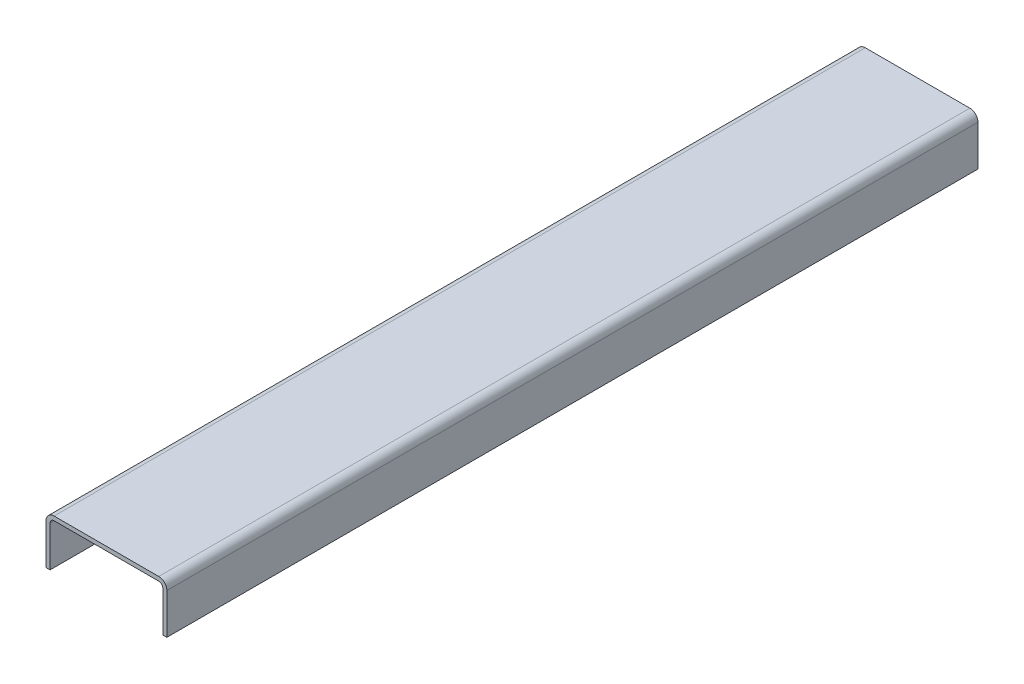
from build123d import *

# Parameters (mm, degrees)
BASE_EXTRUSION_DEPTH = 1000


with BuildPart() as part:
    # Esquisse1 → Base-Extrusion (new body)
    with BuildSketch(Plane.XY):
        with BuildLine():
            Line((144, 0), (149, 0))
            Line((149, 0), (149, 50))
            ThreePointArc((149, 50), (146.071067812, 57.071067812), (139, 60))
            Line((139, 60), (10, 60))
            ThreePointArc((10, 60), (2.928932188, 57.071067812), (0, 50))
            Line((0, 50), (0, 0))
            Line((0, 0), (5, 0))
            Line((5, 0), (5, 50))
            ThreePointArc((5, 50), (6.464466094, 53.535533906), (10, 55))
            Line((10, 55), (139, 55))
            ThreePointArc((139, 55), (142.535533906, 53.535533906), (144, 50))
            Line((144, 50), (144, 0))
        make_face()
    extrude(amount=BASE_EXTRUSION_DEPTH)


solid = part.part
